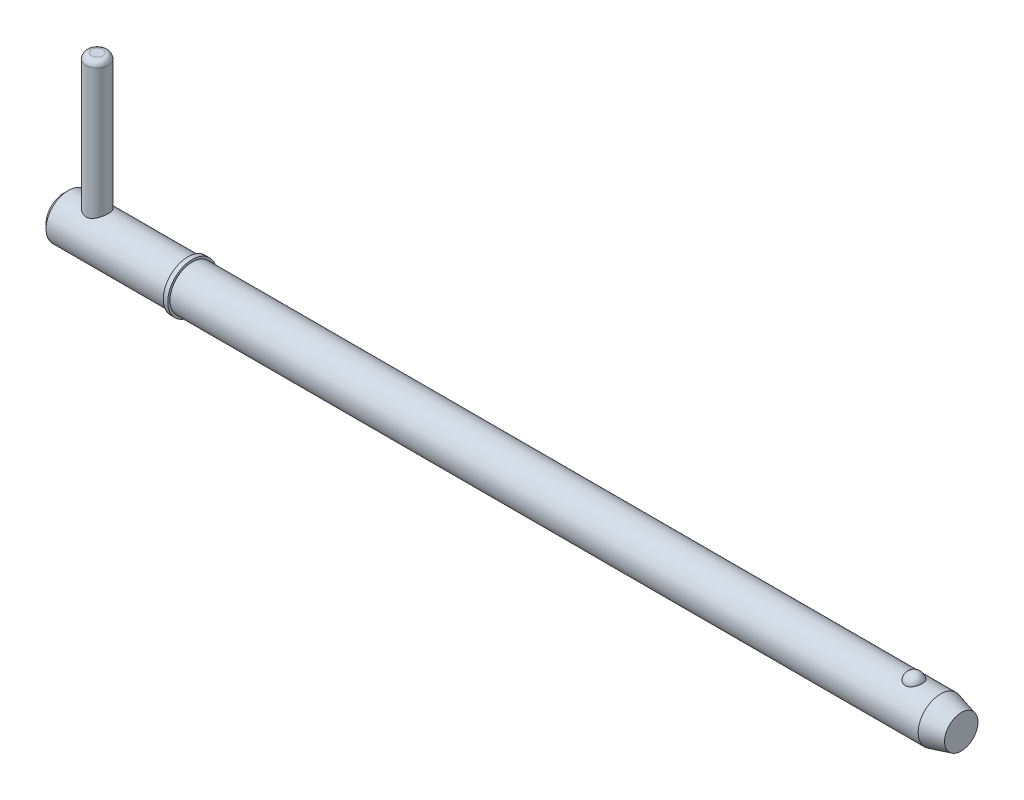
ISO-10303-21;
HEADER;
FILE_DESCRIPTION(('STEP AP214'),'2;1');
FILE_NAME('part.step','',(''),(''),'','','');
FILE_SCHEMA(('AUTOMOTIVE_DESIGN { 1 0 10303 214 1 1 1 1 }'));
ENDSEC;
DATA;
#1=APPLICATION_CONTEXT('core data for automotive mechanical design processes');
#2=APPLICATION_PROTOCOL_DEFINITION('international standard','automotive_design',2000,#1);
#3=PRODUCT_CONTEXT('',#1,'mechanical');
#4=PRODUCT('Part','Part','',(#3));
#5=PRODUCT_RELATED_PRODUCT_CATEGORY('part','',(#4));
#6=PRODUCT_DEFINITION_FORMATION('','',#4);
#7=PRODUCT_DEFINITION_CONTEXT('part definition',#1,'design');
#8=PRODUCT_DEFINITION('design','',#6,#7);
#9=PRODUCT_DEFINITION_SHAPE('','',#8);
#10=(LENGTH_UNIT() NAMED_UNIT(*) SI_UNIT(.MILLI.,.METRE.));
#11=(NAMED_UNIT(*) PLANE_ANGLE_UNIT() SI_UNIT($,.RADIAN.));
#12=(NAMED_UNIT(*) SI_UNIT($,.STERADIAN.) SOLID_ANGLE_UNIT());
#13=UNCERTAINTY_MEASURE_WITH_UNIT(LENGTH_MEASURE(1.E-05),#10,'distance_accuracy_value','');
#14=(GEOMETRIC_REPRESENTATION_CONTEXT(3) GLOBAL_UNCERTAINTY_ASSIGNED_CONTEXT((#13)) GLOBAL_UNIT_ASSIGNED_CONTEXT((#10,
#11,#12)) REPRESENTATION_CONTEXT('',''));
#15=CARTESIAN_POINT('',(0.,0.,0.));
#16=DIRECTION('',(0.,0.,1.));
#17=DIRECTION('',(1.,0.,0.));
#18=AXIS2_PLACEMENT_3D('',#15,#16,#17);
#19=CARTESIAN_POINT('',(4.755,22.225,0.));
#20=DIRECTION('',(0.,-1.,0.));
#21=DIRECTION('',(0.,0.,-1.));
#22=AXIS2_PLACEMENT_3D('',#19,#20,#21);
#23=CYLINDRICAL_SURFACE('',#22,1.585);
#24=CARTESIAN_POINT('',(4.755,-2.3825,0.));
#25=DIRECTION('',(0.,1.,0.));
#26=DIRECTION('',(0.,0.,1.));
#27=AXIS2_PLACEMENT_3D('',#24,#25,#26);
#28=CIRCLE('',#27,1.585);
#29=CARTESIAN_POINT('',(4.755,-2.3825,1.585));
#30=VERTEX_POINT('',#29);
#31=EDGE_CURVE('P0_E25',#30,#30,#28,.T.);
#32=ORIENTED_EDGE('',*,*,#31,.T.);
#33=EDGE_LOOP('',(#32));
#34=FACE_BOUND('',#33,.T.);
#35=CARTESIAN_POINT('',(4.755,21.4325,0.));
#36=DIRECTION('',(0.,1.,0.));
#37=DIRECTION('',(0.,0.,1.));
#38=AXIS2_PLACEMENT_3D('',#35,#36,#37);
#39=CIRCLE('',#38,1.585);
#40=CARTESIAN_POINT('',(4.755,21.4325,1.585));
#41=VERTEX_POINT('',#40);
#42=EDGE_CURVE('P0_E29',#41,#41,#39,.F.);
#43=ORIENTED_EDGE('',*,*,#42,.T.);
#44=EDGE_LOOP('',(#43));
#45=FACE_BOUND('',#44,.T.);
#46=ADVANCED_FACE('P0_F14',(#34,#45),#23,.T.);
#47=CARTESIAN_POINT('',(4.755,22.225,0.));
#48=DIRECTION('',(0.,1.,0.));
#49=DIRECTION('',(0.,0.,1.));
#50=AXIS2_PLACEMENT_3D('',#47,#48,#49);
#51=PLANE('',#50);
#52=CARTESIAN_POINT('',(4.755,22.225,0.));
#53=DIRECTION('',(0.,1.,0.));
#54=DIRECTION('',(0.,0.,1.));
#55=AXIS2_PLACEMENT_3D('',#52,#53,#54);
#56=CIRCLE('',#55,0.7925);
#57=CARTESIAN_POINT('',(4.755,22.225,0.7925));
#58=VERTEX_POINT('',#57);
#59=EDGE_CURVE('P0_E10',#58,#58,#56,.T.);
#60=ORIENTED_EDGE('',*,*,#59,.T.);
#61=EDGE_LOOP('',(#60));
#62=FACE_BOUND('',#61,.T.);
#63=ADVANCED_FACE('P0_F46',(#62),#51,.T.);
#64=CARTESIAN_POINT('',(4.755,-3.175,0.));
#65=DIRECTION('',(0.,1.,0.));
#66=DIRECTION('',(0.,0.,1.));
#67=AXIS2_PLACEMENT_3D('',#64,#65,#66);
#68=PLANE('',#67);
#69=CARTESIAN_POINT('',(4.755,-3.175,0.));
#70=DIRECTION('',(0.,1.,0.));
#71=DIRECTION('',(0.,0.,1.));
#72=AXIS2_PLACEMENT_3D('',#69,#70,#71);
#73=CIRCLE('',#72,0.7925);
#74=CARTESIAN_POINT('',(4.755,-3.175,0.7925));
#75=VERTEX_POINT('',#74);
#76=EDGE_CURVE('P0_E21',#75,#75,#73,.F.);
#77=ORIENTED_EDGE('',*,*,#76,.T.);
#78=EDGE_LOOP('',(#77));
#79=FACE_BOUND('',#78,.T.);
#80=ADVANCED_FACE('P0_F43',(#79),#68,.F.);
#81=CARTESIAN_POINT('',(4.755,-2.3825,0.));
#82=DIRECTION('',(0.,1.,0.));
#83=DIRECTION('',(0.,0.,1.));
#84=AXIS2_PLACEMENT_3D('',#81,#82,#83);
#85=DEGENERATE_TOROIDAL_SURFACE('',#84,0.7925,0.7925,.T.);
#86=ORIENTED_EDGE('',*,*,#76,.F.);
#87=EDGE_LOOP('',(#86));
#88=FACE_BOUND('',#87,.T.);
#89=ORIENTED_EDGE('',*,*,#31,.F.);
#90=EDGE_LOOP('',(#89));
#91=FACE_BOUND('',#90,.T.);
#92=ADVANCED_FACE('P0_F38',(#88,#91),#85,.T.);
#93=CARTESIAN_POINT('',(4.755,21.4325,0.));
#94=DIRECTION('',(0.,1.,0.));
#95=DIRECTION('',(0.,0.,1.));
#96=AXIS2_PLACEMENT_3D('',#93,#94,#95);
#97=DEGENERATE_TOROIDAL_SURFACE('',#96,0.7925,0.7925,.T.);
#98=ORIENTED_EDGE('',*,*,#42,.F.);
#99=EDGE_LOOP('',(#98));
#100=FACE_BOUND('',#99,.T.);
#101=ORIENTED_EDGE('',*,*,#59,.F.);
#102=EDGE_LOOP('',(#101));
#103=FACE_BOUND('',#102,.T.);
#104=ADVANCED_FACE('P0_F16',(#100,#103),#97,.T.);
#105=CLOSED_SHELL('',(#46,#63,#80,#92,#104));
#106=MANIFOLD_SOLID_BREP('P0_B1',#105);
#107=CARTESIAN_POINT('',(0.,0.,0.));
#108=DIRECTION('',(1.,0.,0.));
#109=DIRECTION('',(0.,0.,-1.));
#110=AXIS2_PLACEMENT_3D('',#107,#108,#109);
#111=CYLINDRICAL_SURFACE('',#110,3.175);
#112=CARTESIAN_POINT('',(124.847684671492,0.,0.));
#113=DIRECTION('',(1.,0.,0.));
#114=DIRECTION('',(0.,0.,-1.));
#115=AXIS2_PLACEMENT_3D('',#112,#113,#114);
#116=CIRCLE('',#115,3.175);
#117=CARTESIAN_POINT('',(124.847684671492,0.,-3.175));
#118=VERTEX_POINT('',#117);
#119=EDGE_CURVE('P1_E81',#118,#118,#116,.T.);
#120=ORIENTED_EDGE('',*,*,#119,.F.);
#121=EDGE_LOOP('',(#120));
#122=FACE_BOUND('',#121,.T.);
#123=CARTESIAN_POINT('',(18.29,0.,0.));
#124=DIRECTION('',(1.,0.,0.));
#125=DIRECTION('',(0.,0.,-1.));
#126=AXIS2_PLACEMENT_3D('',#123,#124,#125);
#127=CIRCLE('',#126,3.175);
#128=CARTESIAN_POINT('',(18.29,0.,-3.175));
#129=VERTEX_POINT('',#128);
#130=EDGE_CURVE('P1_E85',#129,#129,#127,.T.);
#131=ORIENTED_EDGE('',*,*,#130,.T.);
#132=EDGE_LOOP('',(#131));
#133=FACE_BOUND('',#132,.T.);
#134=CARTESIAN_POINT('',(121.07572762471,2.92898950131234,1.22541646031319));
#135=CARTESIAN_POINT('',(121.012316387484,2.92899434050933,1.22541146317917));
#136=CARTESIAN_POINT('',(120.948797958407,2.93112688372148,1.22034641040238));
#137=CARTESIAN_POINT('',(120.823530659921,2.93942752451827,1.20020949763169));
#138=CARTESIAN_POINT('',(120.761786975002,2.94560639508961,1.18511092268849));
#139=CARTESIAN_POINT('',(120.642065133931,2.96127115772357,1.1454035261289));
#140=CARTESIAN_POINT('',(120.584077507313,2.97074831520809,1.1208198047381));
#141=CARTESIAN_POINT('',(120.473194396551,2.99197584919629,1.06285154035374));
#142=CARTESIAN_POINT('',(120.420296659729,3.0037252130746,1.02947091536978));
#143=CARTESIAN_POINT('',(120.319268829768,3.02865714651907,0.953674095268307));
#144=CARTESIAN_POINT('',(120.271324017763,3.04187163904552,0.911021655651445));
#145=CARTESIAN_POINT('',(120.183036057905,3.06808741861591,0.8184003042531));
#146=CARTESIAN_POINT('',(120.142695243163,3.08108863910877,0.768429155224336));
#147=CARTESIAN_POINT('',(120.068803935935,3.10614903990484,0.660064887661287));
#148=CARTESIAN_POINT('',(120.035633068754,3.11814104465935,0.601396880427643));
#149=CARTESIAN_POINT('',(119.979119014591,3.13926931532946,0.479026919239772));
#150=CARTESIAN_POINT('',(119.955776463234,3.14840539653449,0.415324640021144));
#151=CARTESIAN_POINT('',(119.919178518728,3.16298160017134,0.283885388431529));
#152=CARTESIAN_POINT('',(119.906040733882,3.16837855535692,0.216110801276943));
#153=CARTESIAN_POINT('',(119.890567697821,3.17475386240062,0.079136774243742));
#154=CARTESIAN_POINT('',(119.888232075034,3.17573236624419,0.00993738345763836));
#155=CARTESIAN_POINT('',(119.894388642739,3.17318075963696,-0.127420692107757));
#156=CARTESIAN_POINT('',(119.902807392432,3.16968122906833,-0.195583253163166));
#157=CARTESIAN_POINT('',(119.930175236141,3.1585790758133,-0.32941342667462));
#158=CARTESIAN_POINT('',(119.949124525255,3.15097637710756,-0.395080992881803));
#159=CARTESIAN_POINT('',(119.997205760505,3.13242485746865,-0.522180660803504));
#160=CARTESIAN_POINT('',(120.026352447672,3.12147119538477,-0.583606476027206));
#161=CARTESIAN_POINT('',(120.094235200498,3.09734973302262,-0.700436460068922));
#162=CARTESIAN_POINT('',(120.132972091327,3.08418174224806,-0.755840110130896));
#163=CARTESIAN_POINT('',(120.219477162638,3.05694884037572,-0.859404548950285));
#164=CARTESIAN_POINT('',(120.267296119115,3.04287919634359,-0.907521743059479));
#165=CARTESIAN_POINT('',(120.370735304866,3.01548927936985,-0.994758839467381));
#166=CARTESIAN_POINT('',(120.426354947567,3.0021689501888,-1.03387941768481));
#167=CARTESIAN_POINT('',(120.542809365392,2.97810316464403,-1.10126594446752));
#168=CARTESIAN_POINT('',(120.603518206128,2.96731170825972,-1.12973256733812));
#169=CARTESIAN_POINT('',(120.729371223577,2.94928934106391,-1.17598467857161));
#170=CARTESIAN_POINT('',(120.794513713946,2.94205708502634,-1.19377420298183));
#171=CARTESIAN_POINT('',(120.923856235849,2.93233065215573,-1.21746387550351));
#172=CARTESIAN_POINT('',(120.987938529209,2.92961621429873,-1.22391763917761));
#173=CARTESIAN_POINT('',(121.116337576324,2.92855752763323,-1.22644976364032));
#174=CARTESIAN_POINT('',(121.180654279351,2.93021238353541,-1.22253024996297));
#175=CARTESIAN_POINT('',(121.305523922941,2.93756851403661,-1.20474140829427));
#176=CARTESIAN_POINT('',(121.366131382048,2.94313790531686,-1.1911962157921));
#177=CARTESIAN_POINT('',(121.484110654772,2.95756226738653,-1.15491492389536));
#178=CARTESIAN_POINT('',(121.541482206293,2.96641750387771,-1.13217808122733));
#179=CARTESIAN_POINT('',(121.652769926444,2.98669918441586,-1.07755083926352));
#180=CARTESIAN_POINT('',(121.706584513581,2.9981771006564,-1.04547308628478));
#181=CARTESIAN_POINT('',(121.808147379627,3.02240235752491,-0.973220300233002));
#182=CARTESIAN_POINT('',(121.855894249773,3.03514999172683,-0.933043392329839));
#183=CARTESIAN_POINT('',(121.946581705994,3.06131230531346,-0.843372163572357));
#184=CARTESIAN_POINT('',(121.989158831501,3.07472822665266,-0.793510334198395));
#185=CARTESIAN_POINT('',(122.065676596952,3.10021106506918,-0.687241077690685));
#186=CARTESIAN_POINT('',(122.099615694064,3.1122777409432,-0.630832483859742));
#187=CARTESIAN_POINT('',(122.159120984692,3.134208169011,-0.511059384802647));
#188=CARTESIAN_POINT('',(122.184389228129,3.14399040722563,-0.447531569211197));
#189=CARTESIAN_POINT('',(122.224511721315,3.15983820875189,-0.316827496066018));
#190=CARTESIAN_POINT('',(122.239365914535,3.16590375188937,-0.249651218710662));
#191=CARTESIAN_POINT('',(122.258358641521,3.17370076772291,-0.113549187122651));
#192=CARTESIAN_POINT('',(122.262496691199,3.17543204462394,-0.0446233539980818));
#193=CARTESIAN_POINT('',(122.259969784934,3.17438372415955,0.09299382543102));
#194=CARTESIAN_POINT('',(122.253305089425,3.17160423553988,0.16168517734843));
#195=CARTESIAN_POINT('',(122.229375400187,3.1618438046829,0.296502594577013));
#196=CARTESIAN_POINT('',(122.212167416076,3.15488546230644,0.362640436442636));
#197=CARTESIAN_POINT('',(122.167547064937,3.13748892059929,0.490896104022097));
#198=CARTESIAN_POINT('',(122.140133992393,3.12705048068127,0.553013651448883));
#199=CARTESIAN_POINT('',(122.075462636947,3.10369139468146,0.671876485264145));
#200=CARTESIAN_POINT('',(122.038146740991,3.0907563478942,0.728587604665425));
#201=CARTESIAN_POINT('',(121.954524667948,3.06381731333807,0.83465359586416));
#202=CARTESIAN_POINT('',(121.908218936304,3.04981337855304,0.884008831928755));
#203=CARTESIAN_POINT('',(121.807718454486,3.02230423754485,0.973916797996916));
#204=CARTESIAN_POINT('',(121.753535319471,3.00879833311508,1.01448227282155));
#205=CARTESIAN_POINT('',(121.638529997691,2.98383625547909,1.08571550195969));
#206=CARTESIAN_POINT('',(121.577705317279,2.97238085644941,1.11637952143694));
#207=CARTESIAN_POINT('',(121.453369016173,2.95329063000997,1.16592590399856));
#208=CARTESIAN_POINT('',(121.390023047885,2.94553738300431,1.1851790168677));
#209=CARTESIAN_POINT('',(121.26076644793,2.9342556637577,1.2128480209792));
#210=CARTESIAN_POINT('',(121.194864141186,2.93071450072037,1.22129647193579));
#211=CARTESIAN_POINT('',(121.111116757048,2.9291525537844,1.22502505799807));
#212=CARTESIAN_POINT('',(121.093426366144,2.9289881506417,1.22541785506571));
#213=CARTESIAN_POINT('',(121.07572762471,2.92898950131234,1.22541646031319));
#214=B_SPLINE_CURVE_WITH_KNOTS('',3,(#134,#135,#136,#137,#138,#139,#140,#141,#142,#143,#144,
#145,#146,#147,#148,#149,#150,#151,#152,#153,#154,#155,#156,#157,#158,#159,#160,#161,#162,#163,
#164,#165,#166,#167,#168,#169,#170,#171,#172,#173,#174,#175,#176,#177,#178,#179,#180,#181,#182,
#183,#184,#185,#186,#187,#188,#189,#190,#191,#192,#193,#194,#195,#196,#197,#198,#199,#200,#201,
#202,#203,#204,#205,#206,#207,#208,#209,#210,#211,#212,#213),.UNSPECIFIED.,.T.,.F.,(4,2,2,2,2,2,
2,2,2,2,2,2,2,2,2,2,2,2,2,2,2,2,2,2,2,2,2,2,2,2,2,2,2,2,2,2,2,2,2,4),(0.,0.19018620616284,
0.380880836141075,0.571074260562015,0.76118311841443,0.956866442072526,1.1526097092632,
1.35701770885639,1.56143892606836,1.76818248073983,1.9749189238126,2.18025109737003,
2.3855870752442,2.59122111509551,2.79687285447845,3.00371012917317,3.21053185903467,
3.41323429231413,3.61586005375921,3.80828192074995,4.0006643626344,4.18685798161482,
4.37306665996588,4.56330302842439,4.75358348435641,4.95345287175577,5.1533579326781,
5.3595700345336,5.56578325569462,5.77200579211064,5.97822335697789,6.18333558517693,
6.38846199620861,6.59480900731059,6.80114579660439,7.00718137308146,7.21329457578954,
7.41228022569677,7.61066481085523,7.66374777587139),.UNSPECIFIED.);
#215=CARTESIAN_POINT('',(121.07572762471,2.92898950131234,1.22541646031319));
#216=VERTEX_POINT('',#215);
#217=EDGE_CURVE('P1_E35',#216,#216,#214,.T.);
#218=ORIENTED_EDGE('',*,*,#217,.T.);
#219=EDGE_LOOP('',(#218));
#220=FACE_BOUND('',#219,.T.);
#221=ADVANCED_FACE('P1_F13',(#122,#133,#220),#111,.T.);
#222=CARTESIAN_POINT('',(0.,0.,0.));
#223=DIRECTION('',(-1.,0.,0.));
#224=DIRECTION('',(0.,0.,1.));
#225=AXIS2_PLACEMENT_3D('',#222,#223,#224);
#226=PLANE('',#225);
#227=CARTESIAN_POINT('',(0.,0.,0.));
#228=DIRECTION('',(1.,0.,0.));
#229=DIRECTION('',(0.,0.,-1.));
#230=AXIS2_PLACEMENT_3D('',#227,#228,#229);
#231=CIRCLE('',#230,2.54);
#232=CARTESIAN_POINT('',(0.,0.,-2.54));
#233=VERTEX_POINT('',#232);
#234=EDGE_CURVE('P1_E9',#233,#233,#231,.T.);
#235=ORIENTED_EDGE('',*,*,#234,.F.);
#236=EDGE_LOOP('',(#235));
#237=FACE_BOUND('',#236,.T.);
#238=ADVANCED_FACE('P1_F15',(#237),#226,.T.);
#239=CARTESIAN_POINT('',(0.634999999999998,0.,0.));
#240=DIRECTION('',(1.,0.,0.));
#241=DIRECTION('',(0.,0.,-1.));
#242=AXIS2_PLACEMENT_3D('',#239,#240,#241);
#243=CONICAL_SURFACE('',#242,3.175,0.78539816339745);
#244=ORIENTED_EDGE('',*,*,#234,.T.);
#245=EDGE_LOOP('',(#244));
#246=FACE_BOUND('',#245,.T.);
#247=CARTESIAN_POINT('',(0.634999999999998,0.,0.));
#248=DIRECTION('',(1.,0.,0.));
#249=DIRECTION('',(0.,0.,-1.));
#250=AXIS2_PLACEMENT_3D('',#247,#248,#249);
#251=CIRCLE('',#250,3.175);
#252=CARTESIAN_POINT('',(0.634999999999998,0.,-3.175));
#253=VERTEX_POINT('',#252);
#254=EDGE_CURVE('P1_E26',#253,#253,#251,.T.);
#255=ORIENTED_EDGE('',*,*,#254,.F.);
#256=EDGE_LOOP('',(#255));
#257=FACE_BOUND('',#256,.T.);
#258=ADVANCED_FACE('P1_F77',(#246,#257),#243,.T.);
#259=CARTESIAN_POINT('',(0.,0.,0.));
#260=DIRECTION('',(1.,0.,0.));
#261=DIRECTION('',(0.,0.,-1.));
#262=AXIS2_PLACEMENT_3D('',#259,#260,#261);
#263=CYLINDRICAL_SURFACE('',#262,3.175);
#264=CARTESIAN_POINT('',(4.755,-2.75107251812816,1.585));
#265=CARTESIAN_POINT('',(4.67238891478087,-2.7510796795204,1.58499425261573));
#266=CARTESIAN_POINT('',(4.58967306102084,-2.75485010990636,1.57849830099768));
#267=CARTESIAN_POINT('',(4.42677850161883,-2.76938647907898,1.55284486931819));
#268=CARTESIAN_POINT('',(4.34660551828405,-2.78016716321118,1.53366069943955));
#269=CARTESIAN_POINT('',(4.19146029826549,-2.80716278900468,1.48366329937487));
#270=CARTESIAN_POINT('',(4.11646293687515,-2.8233488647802,1.45291173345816));
#271=CARTESIAN_POINT('',(3.97271079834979,-2.85928672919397,1.38084067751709));
#272=CARTESIAN_POINT('',(3.90395634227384,-2.87903870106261,1.33952064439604));
#273=CARTESIAN_POINT('',(3.76839976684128,-2.921867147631,1.24350234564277));
#274=CARTESIAN_POINT('',(3.702222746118,-2.94508343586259,1.18798355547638));
#275=CARTESIAN_POINT('',(3.5796334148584,-2.99109588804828,1.06685014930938));
#276=CARTESIAN_POINT('',(3.52322596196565,-3.01389183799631,1.00123054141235));
#277=CARTESIAN_POINT('',(3.41807024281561,-3.05832598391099,0.856373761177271));
#278=CARTESIAN_POINT('',(3.37009053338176,-3.07978367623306,0.776518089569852));
#279=CARTESIAN_POINT('',(3.28853137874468,-3.11730894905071,0.608596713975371));
#280=CARTESIAN_POINT('',(3.25494287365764,-3.1333799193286,0.520536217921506));
#281=CARTESIAN_POINT('',(3.20559401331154,-3.15731341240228,0.345327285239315));
#282=CARTESIAN_POINT('',(3.18873760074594,-3.16567752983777,0.258557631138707));
#283=CARTESIAN_POINT('',(3.16972238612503,-3.17512718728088,0.0830496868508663));
#284=CARTESIAN_POINT('',(3.16755472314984,-3.17621711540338,-0.00568738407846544));
#285=CARTESIAN_POINT('',(3.1775542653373,-3.17123385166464,-0.174372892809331));
#286=CARTESIAN_POINT('',(3.18849502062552,-3.16577346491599,-0.254416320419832));
#287=CARTESIAN_POINT('',(3.22220680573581,-3.14922844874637,-0.411354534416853));
#288=CARTESIAN_POINT('',(3.2449787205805,-3.13814339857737,-0.488249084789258));
#289=CARTESIAN_POINT('',(3.30185558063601,-3.111172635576,-0.638050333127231));
#290=CARTESIAN_POINT('',(3.33611332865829,-3.09522247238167,-0.710886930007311));
#291=CARTESIAN_POINT('',(3.41477890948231,-3.05996035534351,-0.849953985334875));
#292=CARTESIAN_POINT('',(3.45919037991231,-3.04064719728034,-0.916182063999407));
#293=CARTESIAN_POINT('',(3.5617148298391,-2.99832415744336,-1.04681642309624));
#294=CARTESIAN_POINT('',(3.62072497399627,-2.97513741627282,-1.11046186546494));
#295=CARTESIAN_POINT('',(3.7483697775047,-2.92885066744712,-1.22736291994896));
#296=CARTESIAN_POINT('',(3.81701173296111,-2.90575073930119,-1.2806105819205));
#297=CARTESIAN_POINT('',(3.96727993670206,-2.86067370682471,-1.37849835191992));
#298=CARTESIAN_POINT('',(4.04945242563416,-2.83885964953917,-1.42238246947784));
#299=CARTESIAN_POINT('',(4.2213558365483,-2.80110454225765,-1.49537418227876));
#300=CARTESIAN_POINT('',(4.3110787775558,-2.78515738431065,-1.52449715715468));
#301=CARTESIAN_POINT('',(4.48806324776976,-2.76271292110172,-1.56478065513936));
#302=CARTESIAN_POINT('',(4.57495732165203,-2.75556745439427,-1.57718067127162));
#303=CARTESIAN_POINT('',(4.74985771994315,-2.74969306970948,-1.58740564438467));
#304=CARTESIAN_POINT('',(4.8378632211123,-2.75095824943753,-1.58524082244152));
#305=CARTESIAN_POINT('',(5.00227282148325,-2.76107477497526,-1.56753530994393));
#306=CARTESIAN_POINT('',(5.07889680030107,-2.76908515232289,-1.55347662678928));
#307=CARTESIAN_POINT('',(5.22855309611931,-2.79054849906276,-1.51458035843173));
#308=CARTESIAN_POINT('',(5.30158424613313,-2.80400322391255,-1.489739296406));
#309=CARTESIAN_POINT('',(5.44583114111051,-2.83556995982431,-1.42877335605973));
#310=CARTESIAN_POINT('',(5.51680600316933,-2.85386886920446,-1.39217900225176));
#311=CARTESIAN_POINT('',(5.6520174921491,-2.89289503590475,-1.30915485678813));
#312=CARTESIAN_POINT('',(5.71625063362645,-2.91362353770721,-1.26272001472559));
#313=CARTESIAN_POINT('',(5.8445938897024,-2.95830220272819,-1.15451693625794));
#314=CARTESIAN_POINT('',(5.90767560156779,-2.98233004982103,-1.09155543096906));
#315=CARTESIAN_POINT('',(6.0226995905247,-3.02864458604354,-0.955560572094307));
#316=CARTESIAN_POINT('',(6.07463814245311,-3.05093069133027,-0.882523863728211));
#317=CARTESIAN_POINT('',(6.16704288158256,-3.09200671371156,-0.725836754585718));
#318=CARTESIAN_POINT('',(6.20717458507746,-3.11069030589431,-0.64195924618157));
#319=CARTESIAN_POINT('',(6.27235859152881,-3.1416474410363,-0.467442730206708));
#320=CARTESIAN_POINT('',(6.29742409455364,-3.15392659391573,-0.376809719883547));
#321=CARTESIAN_POINT('',(6.32960989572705,-3.16979844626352,-0.200314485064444));
#322=CARTESIAN_POINT('',(6.33816324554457,-3.17408359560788,-0.114775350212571));
#323=CARTESIAN_POINT('',(6.34130309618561,-3.17565001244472,0.0566108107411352));
#324=CARTESIAN_POINT('',(6.33589445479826,-3.17293371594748,0.142457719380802));
#325=CARTESIAN_POINT('',(6.31221457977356,-3.16120608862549,0.306097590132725));
#326=CARTESIAN_POINT('',(6.2948097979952,-3.15261910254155,0.38404960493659));
#327=CARTESIAN_POINT('',(6.24879775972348,-3.13040364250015,0.535801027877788));
#328=CARTESIAN_POINT('',(6.22018889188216,-3.11677444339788,0.609599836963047));
#329=CARTESIAN_POINT('',(6.15130303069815,-3.08497808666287,0.754502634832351));
#330=CARTESIAN_POINT('',(6.11057850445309,-3.0666414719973,0.82535556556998));
#331=CARTESIAN_POINT('',(6.01917980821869,-3.02735012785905,0.95951596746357));
#332=CARTESIAN_POINT('',(5.96850106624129,-3.00639419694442,1.02281994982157));
#333=CARTESIAN_POINT('',(5.8528006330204,-2.96149402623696,1.1467073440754));
#334=CARTESIAN_POINT('',(5.78685463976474,-2.93745961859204,1.20639723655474));
#335=CARTESIAN_POINT('',(5.64552278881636,-2.89084502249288,1.31419099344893));
#336=CARTESIAN_POINT('',(5.57012871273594,-2.8682661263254,1.36228466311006));
#337=CARTESIAN_POINT('',(5.40892145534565,-2.82661780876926,1.44677201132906));
#338=CARTESIAN_POINT('',(5.32285703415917,-2.80767948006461,1.48275497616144));
#339=CARTESIAN_POINT('',(5.14469010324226,-2.77716572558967,1.53916557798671));
#340=CARTESIAN_POINT('',(5.05260892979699,-2.76556569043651,1.55964525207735));
#341=CARTESIAN_POINT('',(4.92544162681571,-2.75613775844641,1.57618070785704));
#342=CARTESIAN_POINT('',(4.89147210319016,-2.75424493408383,1.57948285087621));
#343=CARTESIAN_POINT('',(4.82334103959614,-2.75171079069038,1.58389375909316));
#344=CARTESIAN_POINT('',(4.78917948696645,-2.75106955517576,1.58500237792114));
#345=CARTESIAN_POINT('',(4.755,-2.75107251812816,1.585));
#346=B_SPLINE_CURVE_WITH_KNOTS('',3,(#264,#265,#266,#267,#268,#269,#270,#271,#272,#273,#274,
#275,#276,#277,#278,#279,#280,#281,#282,#283,#284,#285,#286,#287,#288,#289,#290,#291,#292,#293,
#294,#295,#296,#297,#298,#299,#300,#301,#302,#303,#304,#305,#306,#307,#308,#309,#310,#311,#312,
#313,#314,#315,#316,#317,#318,#319,#320,#321,#322,#323,#324,#325,#326,#327,#328,#329,#330,#331,
#332,#333,#334,#335,#336,#337,#338,#339,#340,#341,#342,#343,#344,#345),.UNSPECIFIED.,.T.,.F.,(4,
2,2,2,2,2,2,2,2,2,2,2,2,2,2,2,2,2,2,2,2,2,2,2,2,2,2,2,2,2,2,2,2,2,2,2,2,2,2,2,4),(0.,
0.247689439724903,0.495901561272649,0.742808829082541,0.989728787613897,1.25694656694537,
1.52429683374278,1.80959781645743,2.0947189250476,2.35960564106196,2.62433255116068,
2.86610932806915,3.1079041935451,3.35305262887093,3.59828902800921,3.86665310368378,
4.13522157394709,4.4207514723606,4.70598326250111,4.9686344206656,5.23110127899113,
5.46499114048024,5.69895647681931,5.94376186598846,6.1886932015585,6.46438263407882,
6.74016408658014,7.0231370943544,7.30586181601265,7.5626977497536,7.81944433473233,
8.05935987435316,8.29930993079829,8.54954401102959,8.79989329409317,9.07508848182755,
9.35052473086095,9.63453318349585,9.91758407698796,10.0200561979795,10.1225351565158),.UNSPECIFIED.);
#347=CARTESIAN_POINT('',(4.755,-2.75107251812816,1.585));
#348=VERTEX_POINT('',#347);
#349=EDGE_CURVE('P1_E17',#348,#348,#346,.T.);
#350=ORIENTED_EDGE('',*,*,#349,.F.);
#351=EDGE_LOOP('',(#350));
#352=FACE_BOUND('',#351,.T.);
#353=CARTESIAN_POINT('',(4.755,2.75107251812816,1.585));
#354=CARTESIAN_POINT('',(4.83761108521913,2.7510796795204,1.58499425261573));
#355=CARTESIAN_POINT('',(4.92032693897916,2.75485010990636,1.57849830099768));
#356=CARTESIAN_POINT('',(5.08322149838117,2.76938647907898,1.55284486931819));
#357=CARTESIAN_POINT('',(5.16339448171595,2.78016716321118,1.53366069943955));
#358=CARTESIAN_POINT('',(5.31853970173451,2.80716278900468,1.48366329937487));
#359=CARTESIAN_POINT('',(5.39353706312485,2.8233488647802,1.45291173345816));
#360=CARTESIAN_POINT('',(5.53728920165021,2.85928672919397,1.38084067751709));
#361=CARTESIAN_POINT('',(5.60604365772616,2.87903870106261,1.33952064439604));
#362=CARTESIAN_POINT('',(5.74160023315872,2.921867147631,1.24350234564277));
#363=CARTESIAN_POINT('',(5.807777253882,2.94508343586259,1.18798355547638));
#364=CARTESIAN_POINT('',(5.9303665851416,2.99109588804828,1.06685014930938));
#365=CARTESIAN_POINT('',(5.98677403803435,3.01389183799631,1.00123054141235));
#366=CARTESIAN_POINT('',(6.09192975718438,3.05832598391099,0.85637376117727));
#367=CARTESIAN_POINT('',(6.13990946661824,3.07978367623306,0.776518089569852));
#368=CARTESIAN_POINT('',(6.22146862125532,3.11730894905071,0.608596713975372));
#369=CARTESIAN_POINT('',(6.25505712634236,3.1333799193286,0.520536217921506));
#370=CARTESIAN_POINT('',(6.30440598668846,3.15731341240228,0.345327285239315));
#371=CARTESIAN_POINT('',(6.32126239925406,3.16567752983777,0.258557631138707));
#372=CARTESIAN_POINT('',(6.34027761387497,3.17512718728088,0.0830496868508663));
#373=CARTESIAN_POINT('',(6.34244527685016,3.17621711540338,-0.00568738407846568));
#374=CARTESIAN_POINT('',(6.3324457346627,3.17123385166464,-0.174372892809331));
#375=CARTESIAN_POINT('',(6.32150497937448,3.16577346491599,-0.254416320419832));
#376=CARTESIAN_POINT('',(6.28779319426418,3.14922844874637,-0.411354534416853));
#377=CARTESIAN_POINT('',(6.2650212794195,3.13814339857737,-0.488249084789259));
#378=CARTESIAN_POINT('',(6.20814441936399,3.111172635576,-0.638050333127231));
#379=CARTESIAN_POINT('',(6.17388667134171,3.09522247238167,-0.710886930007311));
#380=CARTESIAN_POINT('',(6.09522109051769,3.05996035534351,-0.849953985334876));
#381=CARTESIAN_POINT('',(6.05080962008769,3.04064719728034,-0.916182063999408));
#382=CARTESIAN_POINT('',(5.9482851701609,2.99832415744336,-1.04681642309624));
#383=CARTESIAN_POINT('',(5.88927502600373,2.97513741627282,-1.11046186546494));
#384=CARTESIAN_POINT('',(5.7616302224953,2.92885066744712,-1.22736291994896));
#385=CARTESIAN_POINT('',(5.69298826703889,2.90575073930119,-1.2806105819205));
#386=CARTESIAN_POINT('',(5.54272006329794,2.86067370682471,-1.37849835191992));
#387=CARTESIAN_POINT('',(5.46054757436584,2.83885964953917,-1.42238246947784));
#388=CARTESIAN_POINT('',(5.2886441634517,2.80110454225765,-1.49537418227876));
#389=CARTESIAN_POINT('',(5.19892122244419,2.78515738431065,-1.52449715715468));
#390=CARTESIAN_POINT('',(5.02193675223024,2.76271292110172,-1.56478065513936));
#391=CARTESIAN_POINT('',(4.93504267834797,2.75556745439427,-1.57718067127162));
#392=CARTESIAN_POINT('',(4.76014228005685,2.74969306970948,-1.58740564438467));
#393=CARTESIAN_POINT('',(4.6721367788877,2.75095824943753,-1.58524082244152));
#394=CARTESIAN_POINT('',(4.50772717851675,2.76107477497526,-1.56753530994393));
#395=CARTESIAN_POINT('',(4.43110319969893,2.76908515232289,-1.55347662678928));
#396=CARTESIAN_POINT('',(4.28144690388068,2.79054849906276,-1.51458035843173));
#397=CARTESIAN_POINT('',(4.20841575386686,2.80400322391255,-1.489739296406));
#398=CARTESIAN_POINT('',(4.06416885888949,2.83556995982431,-1.42877335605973));
#399=CARTESIAN_POINT('',(3.99319399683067,2.85386886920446,-1.39217900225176));
#400=CARTESIAN_POINT('',(3.8579825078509,2.89289503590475,-1.30915485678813));
#401=CARTESIAN_POINT('',(3.79374936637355,2.91362353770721,-1.26272001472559));
#402=CARTESIAN_POINT('',(3.6654061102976,2.95830220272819,-1.15451693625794));
#403=CARTESIAN_POINT('',(3.60232439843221,2.98233004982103,-1.09155543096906));
#404=CARTESIAN_POINT('',(3.4873004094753,3.02864458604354,-0.955560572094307));
#405=CARTESIAN_POINT('',(3.43536185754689,3.05093069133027,-0.88252386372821));
#406=CARTESIAN_POINT('',(3.34295711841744,3.09200671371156,-0.725836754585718));
#407=CARTESIAN_POINT('',(3.30282541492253,3.11069030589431,-0.64195924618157));
#408=CARTESIAN_POINT('',(3.23764140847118,3.14164744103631,-0.467442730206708));
#409=CARTESIAN_POINT('',(3.21257590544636,3.15392659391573,-0.376809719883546));
#410=CARTESIAN_POINT('',(3.18039010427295,3.16979844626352,-0.200314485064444));
#411=CARTESIAN_POINT('',(3.17183675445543,3.17408359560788,-0.114775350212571));
#412=CARTESIAN_POINT('',(3.16869690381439,3.17565001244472,0.0566108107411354));
#413=CARTESIAN_POINT('',(3.17410554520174,3.17293371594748,0.142457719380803));
#414=CARTESIAN_POINT('',(3.19778542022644,3.16120608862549,0.306097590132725));
#415=CARTESIAN_POINT('',(3.2151902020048,3.15261910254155,0.384049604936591));
#416=CARTESIAN_POINT('',(3.26120224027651,3.13040364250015,0.535801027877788));
#417=CARTESIAN_POINT('',(3.28981110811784,3.11677444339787,0.609599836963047));
#418=CARTESIAN_POINT('',(3.35869696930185,3.08497808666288,0.754502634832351));
#419=CARTESIAN_POINT('',(3.39942149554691,3.0666414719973,0.82535556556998));
#420=CARTESIAN_POINT('',(3.49082019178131,3.02735012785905,0.95951596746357));
#421=CARTESIAN_POINT('',(3.54149893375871,3.00639419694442,1.02281994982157));
#422=CARTESIAN_POINT('',(3.6571993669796,2.96149402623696,1.1467073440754));
#423=CARTESIAN_POINT('',(3.72314536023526,2.93745961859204,1.20639723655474));
#424=CARTESIAN_POINT('',(3.86447721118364,2.89084502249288,1.31419099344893));
#425=CARTESIAN_POINT('',(3.93987128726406,2.8682661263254,1.36228466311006));
#426=CARTESIAN_POINT('',(4.10107854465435,2.82661780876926,1.44677201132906));
#427=CARTESIAN_POINT('',(4.18714296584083,2.80767948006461,1.48275497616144));
#428=CARTESIAN_POINT('',(4.36530989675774,2.77716572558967,1.53916557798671));
#429=CARTESIAN_POINT('',(4.45739107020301,2.76556569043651,1.55964525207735));
#430=CARTESIAN_POINT('',(4.58455837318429,2.75613775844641,1.57618070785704));
#431=CARTESIAN_POINT('',(4.61852789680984,2.75424493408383,1.57948285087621));
#432=CARTESIAN_POINT('',(4.68665896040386,2.75171079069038,1.58389375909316));
#433=CARTESIAN_POINT('',(4.72082051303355,2.75106955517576,1.58500237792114));
#434=CARTESIAN_POINT('',(4.755,2.75107251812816,1.585));
#435=B_SPLINE_CURVE_WITH_KNOTS('',3,(#353,#354,#355,#356,#357,#358,#359,#360,#361,#362,#363,
#364,#365,#366,#367,#368,#369,#370,#371,#372,#373,#374,#375,#376,#377,#378,#379,#380,#381,#382,
#383,#384,#385,#386,#387,#388,#389,#390,#391,#392,#393,#394,#395,#396,#397,#398,#399,#400,#401,
#402,#403,#404,#405,#406,#407,#408,#409,#410,#411,#412,#413,#414,#415,#416,#417,#418,#419,#420,
#421,#422,#423,#424,#425,#426,#427,#428,#429,#430,#431,#432,#433,#434),.UNSPECIFIED.,.T.,.F.,(4,
2,2,2,2,2,2,2,2,2,2,2,2,2,2,2,2,2,2,2,2,2,2,2,2,2,2,2,2,2,2,2,2,2,2,2,2,2,2,2,4),(0.,
0.247689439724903,0.495901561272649,0.742808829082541,0.989728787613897,1.25694656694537,
1.52429683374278,1.80959781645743,2.0947189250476,2.35960564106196,2.62433255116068,
2.86610932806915,3.1079041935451,3.35305262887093,3.59828902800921,3.86665310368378,
4.13522157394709,4.4207514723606,4.70598326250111,4.9686344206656,5.23110127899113,
5.46499114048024,5.69895647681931,5.94376186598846,6.1886932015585,6.46438263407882,
6.74016408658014,7.0231370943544,7.30586181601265,7.5626977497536,7.81944433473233,
8.05935987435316,8.29930993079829,8.54954401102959,8.79989329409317,9.07508848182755,
9.35052473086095,9.63453318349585,9.91758407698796,10.0200561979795,10.1225351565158),.UNSPECIFIED.);
#436=CARTESIAN_POINT('',(4.755,2.75107251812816,1.585));
#437=VERTEX_POINT('',#436);
#438=EDGE_CURVE('P1_E43',#437,#437,#435,.T.);
#439=ORIENTED_EDGE('',*,*,#438,.F.);
#440=EDGE_LOOP('',(#439));
#441=FACE_BOUND('',#440,.T.);
#442=ORIENTED_EDGE('',*,*,#254,.T.);
#443=EDGE_LOOP('',(#442));
#444=FACE_BOUND('',#443,.T.);
#445=CARTESIAN_POINT('',(17.655,0.,0.));
#446=DIRECTION('',(1.,0.,0.));
#447=DIRECTION('',(0.,0.,-1.));
#448=AXIS2_PLACEMENT_3D('',#445,#446,#447);
#449=CIRCLE('',#448,3.175);
#450=CARTESIAN_POINT('',(17.655,0.,-3.175));
#451=VERTEX_POINT('',#450);
#452=EDGE_CURVE('P1_E31',#451,#451,#449,.T.);
#453=ORIENTED_EDGE('',*,*,#452,.F.);
#454=EDGE_LOOP('',(#453));
#455=FACE_BOUND('',#454,.T.);
#456=ADVANCED_FACE('P1_F103',(#352,#441,#444,#455),#263,.T.);
#457=CARTESIAN_POINT('',(17.655,3.175,0.));
#458=DIRECTION('',(-1.,0.,0.));
#459=DIRECTION('',(0.,0.,1.));
#460=AXIS2_PLACEMENT_3D('',#457,#458,#459);
#461=PLANE('',#460);
#462=ORIENTED_EDGE('',*,*,#452,.T.);
#463=EDGE_LOOP('',(#462));
#464=FACE_BOUND('',#463,.T.);
#465=CARTESIAN_POINT('',(17.655,0.,0.));
#466=DIRECTION('',(1.,0.,0.));
#467=DIRECTION('',(0.,0.,-1.));
#468=AXIS2_PLACEMENT_3D('',#465,#466,#467);
#469=CIRCLE('',#468,3.4925);
#470=CARTESIAN_POINT('',(17.655,0.,-3.4925));
#471=VERTEX_POINT('',#470);
#472=EDGE_CURVE('P1_E91',#471,#471,#469,.T.);
#473=ORIENTED_EDGE('',*,*,#472,.F.);
#474=EDGE_LOOP('',(#473));
#475=FACE_BOUND('',#474,.T.);
#476=ADVANCED_FACE('P1_F100',(#464,#475),#461,.T.);
#477=CARTESIAN_POINT('',(0.,0.,0.));
#478=DIRECTION('',(1.,0.,0.));
#479=DIRECTION('',(0.,0.,-1.));
#480=AXIS2_PLACEMENT_3D('',#477,#478,#479);
#481=CYLINDRICAL_SURFACE('',#480,3.4925);
#482=ORIENTED_EDGE('',*,*,#472,.T.);
#483=EDGE_LOOP('',(#482));
#484=FACE_BOUND('',#483,.T.);
#485=CARTESIAN_POINT('',(18.29,0.,0.));
#486=DIRECTION('',(1.,0.,0.));
#487=DIRECTION('',(0.,0.,-1.));
#488=AXIS2_PLACEMENT_3D('',#485,#486,#487);
#489=CIRCLE('',#488,3.4925);
#490=CARTESIAN_POINT('',(18.29,0.,-3.4925));
#491=VERTEX_POINT('',#490);
#492=EDGE_CURVE('P1_E88',#491,#491,#489,.T.);
#493=ORIENTED_EDGE('',*,*,#492,.F.);
#494=EDGE_LOOP('',(#493));
#495=FACE_BOUND('',#494,.T.);
#496=ADVANCED_FACE('P1_F68',(#484,#495),#481,.T.);
#497=CARTESIAN_POINT('',(18.29,3.4925,0.));
#498=DIRECTION('',(1.,0.,0.));
#499=DIRECTION('',(0.,0.,-1.));
#500=AXIS2_PLACEMENT_3D('',#497,#498,#499);
#501=PLANE('',#500);
#502=ORIENTED_EDGE('',*,*,#492,.T.);
#503=EDGE_LOOP('',(#502));
#504=FACE_BOUND('',#503,.T.);
#505=ORIENTED_EDGE('',*,*,#130,.F.);
#506=EDGE_LOOP('',(#505));
#507=FACE_BOUND('',#506,.T.);
#508=ADVANCED_FACE('P1_F62',(#504,#507),#501,.T.);
#509=CARTESIAN_POINT('',(127.81,0.,0.));
#510=DIRECTION('',(-1.,0.,0.));
#511=DIRECTION('',(0.,0.,1.));
#512=AXIS2_PLACEMENT_3D('',#509,#510,#511);
#513=CONICAL_SURFACE('',#512,2.38125000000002,0.261799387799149);
#514=ORIENTED_EDGE('',*,*,#119,.T.);
#515=EDGE_LOOP('',(#514));
#516=FACE_BOUND('',#515,.T.);
#517=CARTESIAN_POINT('',(127.81,0.,0.));
#518=DIRECTION('',(1.,0.,0.));
#519=DIRECTION('',(0.,0.,-1.));
#520=AXIS2_PLACEMENT_3D('',#517,#518,#519);
#521=CIRCLE('',#520,2.38125000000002);
#522=CARTESIAN_POINT('',(127.81,0.,-2.38125000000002));
#523=VERTEX_POINT('',#522);
#524=EDGE_CURVE('P1_E42',#523,#523,#521,.T.);
#525=ORIENTED_EDGE('',*,*,#524,.F.);
#526=EDGE_LOOP('',(#525));
#527=FACE_BOUND('',#526,.T.);
#528=ADVANCED_FACE('P1_F59',(#516,#527),#513,.T.);
#529=CARTESIAN_POINT('',(127.81,2.38125000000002,0.));
#530=DIRECTION('',(1.,0.,0.));
#531=DIRECTION('',(0.,0.,-1.));
#532=AXIS2_PLACEMENT_3D('',#529,#530,#531);
#533=PLANE('',#532);
#534=ORIENTED_EDGE('',*,*,#524,.T.);
#535=EDGE_LOOP('',(#534));
#536=FACE_BOUND('',#535,.T.);
#537=ADVANCED_FACE('P1_F55',(#536),#533,.T.);
#538=CARTESIAN_POINT('',(121.07572762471,2.8575,0.));
#539=DIRECTION('',(-1.,0.,0.));
#540=DIRECTION('',(0.,1.,0.));
#541=AXIS2_PLACEMENT_3D('',#538,#539,#540);
#542=SPHERICAL_SURFACE('',#541,1.22749999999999);
#543=ORIENTED_EDGE('',*,*,#217,.F.);
#544=EDGE_LOOP('',(#543));
#545=FACE_BOUND('',#544,.T.);
#546=ADVANCED_FACE('P1_F50',(#545),#542,.T.);
#547=CARTESIAN_POINT('',(4.755,-3.4925,0.));
#548=DIRECTION('',(0.,1.,0.));
#549=DIRECTION('',(0.,0.,1.));
#550=AXIS2_PLACEMENT_3D('',#547,#548,#549);
#551=CYLINDRICAL_SURFACE('',#550,1.585);
#552=ORIENTED_EDGE('',*,*,#349,.T.);
#553=EDGE_LOOP('',(#552));
#554=FACE_BOUND('',#553,.T.);
#555=ORIENTED_EDGE('',*,*,#438,.T.);
#556=EDGE_LOOP('',(#555));
#557=FACE_BOUND('',#556,.T.);
#558=ADVANCED_FACE('P1_F54',(#554,#557),#551,.F.);
#559=CLOSED_SHELL('',(#221,#238,#258,#456,#476,#496,#508,#528,#537,#546,#558));
#560=MANIFOLD_SOLID_BREP('P1_B1',#559);
#561=ADVANCED_BREP_SHAPE_REPRESENTATION('',(#18,#106,#560),#14);
#562=SHAPE_DEFINITION_REPRESENTATION(#9,#561);
ENDSEC;
END-ISO-10303-21;
